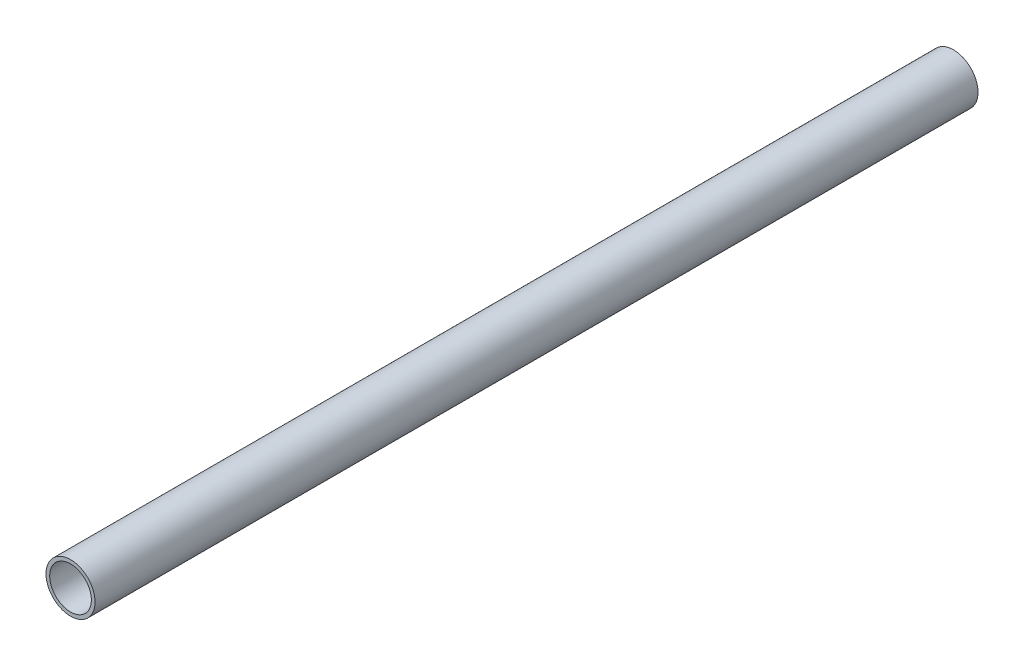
from build123d import *

# Parameters (mm, degrees)
ESQUISSE1_R            = 10
ESQUISSE1_R_2          = 8.5
BASE_EXTRU_MINCE_DEPTH = 360


with BuildPart() as part:
    # Esquisse1 → Base-Extru.-Mince (new body)
    with BuildSketch(Plane.XY):
        Circle(ESQUISSE1_R)
        Circle(ESQUISSE1_R_2, mode=Mode.SUBTRACT)
    extrude(amount=BASE_EXTRU_MINCE_DEPTH)


solid = part.part
